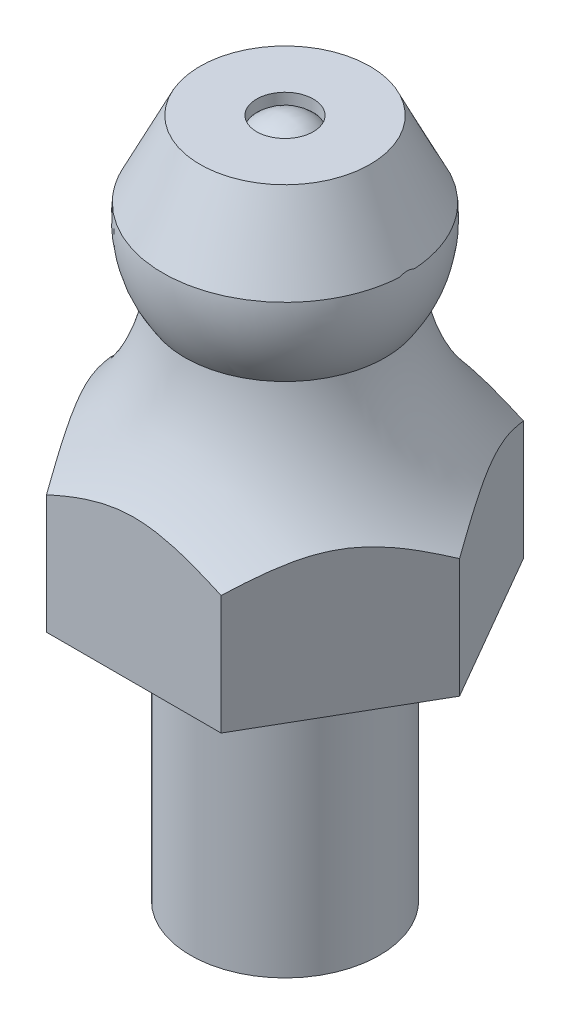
ISO-10303-21;
HEADER;
FILE_DESCRIPTION(('STEP AP214'),'2;1');
FILE_NAME('part.step','',(''),(''),'','','');
FILE_SCHEMA(('AUTOMOTIVE_DESIGN { 1 0 10303 214 1 1 1 1 }'));
ENDSEC;
DATA;
#1=APPLICATION_CONTEXT('core data for automotive mechanical design processes');
#2=APPLICATION_PROTOCOL_DEFINITION('international standard','automotive_design',2000,#1);
#3=PRODUCT_CONTEXT('',#1,'mechanical');
#4=PRODUCT('Part','Part','',(#3));
#5=PRODUCT_RELATED_PRODUCT_CATEGORY('part','',(#4));
#6=PRODUCT_DEFINITION_FORMATION('','',#4);
#7=PRODUCT_DEFINITION_CONTEXT('part definition',#1,'design');
#8=PRODUCT_DEFINITION('design','',#6,#7);
#9=PRODUCT_DEFINITION_SHAPE('','',#8);
#10=(LENGTH_UNIT() NAMED_UNIT(*) SI_UNIT(.MILLI.,.METRE.));
#11=(NAMED_UNIT(*) PLANE_ANGLE_UNIT() SI_UNIT($,.RADIAN.));
#12=(NAMED_UNIT(*) SI_UNIT($,.STERADIAN.) SOLID_ANGLE_UNIT());
#13=UNCERTAINTY_MEASURE_WITH_UNIT(LENGTH_MEASURE(1.E-05),#10,'distance_accuracy_value','');
#14=(GEOMETRIC_REPRESENTATION_CONTEXT(3) GLOBAL_UNCERTAINTY_ASSIGNED_CONTEXT((#13)) GLOBAL_UNIT_ASSIGNED_CONTEXT((#10,
#11,#12)) REPRESENTATION_CONTEXT('',''));
#15=CARTESIAN_POINT('',(0.,0.,0.));
#16=DIRECTION('',(0.,0.,1.));
#17=DIRECTION('',(1.,0.,0.));
#18=AXIS2_PLACEMENT_3D('',#15,#16,#17);
#19=CARTESIAN_POINT('',(-2.3094010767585,18.9047921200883,-4.));
#20=DIRECTION('',(0.,0.,-1.));
#21=DIRECTION('',(-1.,0.,0.));
#22=AXIS2_PLACEMENT_3D('',#19,#20,#21);
#23=PLANE('',#22);
#24=DIRECTION('',(0.,-1.,0.));
#25=VECTOR('',#24,1.);
#26=CARTESIAN_POINT('',(2.3094010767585,18.9047921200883,-4.));
#27=LINE('',#26,#25);
#28=CARTESIAN_POINT('',(2.30940107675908,10.1524874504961,-4.00000000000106));
#29=VERTEX_POINT('',#28);
#30=CARTESIAN_POINT('',(2.3094010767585,7.,-4.));
#31=VERTEX_POINT('',#30);
#32=EDGE_CURVE('P0_E61',#29,#31,#27,.T.);
#33=ORIENTED_EDGE('',*,*,#32,.T.);
#34=DIRECTION('',(-1.,0.,0.));
#35=VECTOR('',#34,1.);
#36=CARTESIAN_POINT('',(-2.3094010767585,7.,-4.));
#37=LINE('',#36,#35);
#38=CARTESIAN_POINT('',(-2.3094010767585,7.,-4.));
#39=VERTEX_POINT('',#38);
#40=EDGE_CURVE('P0_E55',#31,#39,#37,.T.);
#41=ORIENTED_EDGE('',*,*,#40,.T.);
#42=DIRECTION('',(0.,-1.,0.));
#43=VECTOR('',#42,1.);
#44=CARTESIAN_POINT('',(-2.3094010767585,18.9047921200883,-4.));
#45=LINE('',#44,#43);
#46=CARTESIAN_POINT('',(-2.3094010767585,10.1524874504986,-4.));
#47=VERTEX_POINT('',#46);
#48=EDGE_CURVE('P0_E128',#47,#39,#45,.T.);
#49=ORIENTED_EDGE('',*,*,#48,.F.);
#50=CARTESIAN_POINT('',(-2.3094010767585,10.1524874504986,-4.00000000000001));
#51=CARTESIAN_POINT('',(-2.24387314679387,10.1816552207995,-4.));
#52=CARTESIAN_POINT('',(-2.17823697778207,10.2105890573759,-4.));
#53=CARTESIAN_POINT('',(-2.0463662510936,10.2678099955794,-4.));
#54=CARTESIAN_POINT('',(-1.98013034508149,10.2960939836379,-4.));
#55=CARTESIAN_POINT('',(-1.84705880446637,10.3516571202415,-4.));
#56=CARTESIAN_POINT('',(-1.78022214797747,10.3789338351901,-4.));
#57=CARTESIAN_POINT('',(-1.64593091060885,10.4320775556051,-4.));
#58=CARTESIAN_POINT('',(-1.57847591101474,10.4579435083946,-4.));
#59=CARTESIAN_POINT('',(-1.44312447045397,10.5077528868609,-4.));
#60=CARTESIAN_POINT('',(-1.37523041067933,10.5317027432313,-4.));
#61=CARTESIAN_POINT('',(-1.23874756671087,10.5773084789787,-4.));
#62=CARTESIAN_POINT('',(-1.17015956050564,10.5989666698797,-4.));
#63=CARTESIAN_POINT('',(-1.03223820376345,10.6395079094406,-4.));
#64=CARTESIAN_POINT('',(-0.96290569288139,10.6583937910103,-4.));
#65=CARTESIAN_POINT('',(-0.823443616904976,10.6929039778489,-4.));
#66=CARTESIAN_POINT('',(-0.75331424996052,10.7085290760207,-4.));
#67=CARTESIAN_POINT('',(-0.613640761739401,10.735769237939,-4.));
#68=CARTESIAN_POINT('',(-0.544110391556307,10.7474541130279,-4.));
#69=CARTESIAN_POINT('',(-0.404466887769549,10.7668044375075,-4.));
#70=CARTESIAN_POINT('',(-0.334353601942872,10.7744688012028,-4.));
#71=CARTESIAN_POINT('',(-0.193792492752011,10.7854743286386,-4.));
#72=CARTESIAN_POINT('',(-0.123344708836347,10.7888159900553,-4.));
#73=CARTESIAN_POINT('',(0.0175925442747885,10.7910392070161,-4.));
#74=CARTESIAN_POINT('',(0.0880819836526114,10.7899226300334,-4.));
#75=CARTESIAN_POINT('',(0.228858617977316,10.783279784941,-4.));
#76=CARTESIAN_POINT('',(0.29914578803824,10.7777529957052,-4.));
#77=CARTESIAN_POINT('',(0.439230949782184,10.7625151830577,-4.));
#78=CARTESIAN_POINT('',(0.509029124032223,10.7528058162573,-4.));
#79=CARTESIAN_POINT('',(0.653519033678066,10.7286356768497,-4.));
#80=CARTESIAN_POINT('',(0.728157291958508,10.7138578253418,-4.));
#81=CARTESIAN_POINT('',(0.876576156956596,10.680398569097,-4.));
#82=CARTESIAN_POINT('',(0.950356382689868,10.6617154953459,-4.));
#83=CARTESIAN_POINT('',(1.09709634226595,10.6210262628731,-4.));
#84=CARTESIAN_POINT('',(1.170054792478,10.5990155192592,-4.));
#85=CARTESIAN_POINT('',(1.3151885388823,10.5522515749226,-4.));
#86=CARTESIAN_POINT('',(1.38736264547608,10.5274947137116,-4.));
#87=CARTESIAN_POINT('',(1.5314843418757,10.4756106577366,-4.));
#88=CARTESIAN_POINT('',(1.60342577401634,10.4484664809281,-4.));
#89=CARTESIAN_POINT('',(1.74657003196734,10.3925021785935,-4.));
#90=CARTESIAN_POINT('',(1.81777350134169,10.3636836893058,-4.));
#91=CARTESIAN_POINT('',(1.95944373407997,10.3048727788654,-4.));
#92=CARTESIAN_POINT('',(2.02991205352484,10.274884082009,-4.));
#93=CARTESIAN_POINT('',(2.17009322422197,10.2141768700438,-4.));
#94=CARTESIAN_POINT('',(2.23980809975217,10.1834630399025,-4.));
#95=CARTESIAN_POINT('',(2.30940107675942,10.1524874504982,-4.));
#96=B_SPLINE_CURVE_WITH_KNOTS('',3,(#50,#51,#52,#53,#54,#55,#56,#57,#58,#59,#60,#61,#62,#63,#64,
#65,#66,#67,#68,#69,#70,#71,#72,#73,#74,#75,#76,#77,#78,#79,#80,#81,#82,#83,#84,#85,#86,#87,#88,
#89,#90,#91,#92,#93,#94,#95),.UNSPECIFIED.,.F.,.F.,(4,2,2,2,2,2,2,2,2,2,2,2,2,2,2,2,2,2,2,2,2,2,
4),(0.,0.215184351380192,0.431245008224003,0.64779743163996,0.86450929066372,1.08046032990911,
1.29619142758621,1.51170052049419,1.72715714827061,1.93856663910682,2.15003318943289,
2.36147539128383,2.57282903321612,2.78420765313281,2.99550262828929,3.22364220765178,
3.45187948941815,3.68043415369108,3.90929722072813,4.13994537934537,4.37037180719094,
4.60011669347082,4.82864951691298),.UNSPECIFIED.);
#97=EDGE_CURVE('P0_E151',#47,#29,#96,.T.);
#98=ORIENTED_EDGE('',*,*,#97,.T.);
#99=EDGE_LOOP('',(#33,#41,#49,#98));
#100=FACE_BOUND('',#99,.T.);
#101=ADVANCED_FACE('P0_F40',(#100),#23,.T.);
#102=CARTESIAN_POINT('',(-4.61880215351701,18.9047921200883,0.));
#103=DIRECTION('',(-0.866025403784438,0.,-0.5));
#104=DIRECTION('',(-0.5,0.,0.866025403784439));
#105=AXIS2_PLACEMENT_3D('',#102,#103,#104);
#106=PLANE('',#105);
#107=ORIENTED_EDGE('',*,*,#48,.T.);
#108=DIRECTION('',(-0.5,0.,0.866025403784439));
#109=VECTOR('',#108,1.);
#110=CARTESIAN_POINT('',(-4.61880215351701,7.,0.));
#111=LINE('',#110,#109);
#112=CARTESIAN_POINT('',(-4.61880215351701,7.,0.));
#113=VERTEX_POINT('',#112);
#114=EDGE_CURVE('P0_E263',#39,#113,#111,.T.);
#115=ORIENTED_EDGE('',*,*,#114,.T.);
#116=DIRECTION('',(0.,-1.,0.));
#117=VECTOR('',#116,1.);
#118=CARTESIAN_POINT('',(-4.61880215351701,18.9047921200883,0.));
#119=LINE('',#118,#117);
#120=CARTESIAN_POINT('',(-4.61880215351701,10.1524874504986,0.));
#121=VERTEX_POINT('',#120);
#122=EDGE_CURVE('P0_E259',#121,#113,#119,.T.);
#123=ORIENTED_EDGE('',*,*,#122,.F.);
#124=CARTESIAN_POINT('',(-4.61880215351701,10.1524874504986,0.));
#125=CARTESIAN_POINT('',(-4.58603818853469,10.1816552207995,-0.0567488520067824));
#126=CARTESIAN_POINT('',(-4.55322010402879,10.2105890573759,-0.113591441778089));
#127=CARTESIAN_POINT('',(-4.48728474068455,10.2678099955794,-0.227794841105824));
#128=CARTESIAN_POINT('',(-4.4541667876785,10.2960939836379,-0.285156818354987));
#129=CARTESIAN_POINT('',(-4.38763101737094,10.3516571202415,-0.400400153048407));
#130=CARTESIAN_POINT('',(-4.35421268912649,10.3789338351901,-0.458282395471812));
#131=CARTESIAN_POINT('',(-4.28706707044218,10.4320775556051,-0.574582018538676));
#132=CARTESIAN_POINT('',(-4.25333957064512,10.4579435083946,-0.632999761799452));
#133=CARTESIAN_POINT('',(-4.18566385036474,10.5077528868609,-0.750217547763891));
#134=CARTESIAN_POINT('',(-4.15171682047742,10.5317027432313,-0.809015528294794));
#135=CARTESIAN_POINT('',(-4.08347539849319,10.5773084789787,-0.927213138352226));
#136=CARTESIAN_POINT('',(-4.04918139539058,10.5989666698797,-0.986612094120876));
#137=CARTESIAN_POINT('',(-3.98022071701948,10.6395079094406,-1.10605549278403));
#138=CARTESIAN_POINT('',(-3.94555446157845,10.6583937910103,-1.16609920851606));
#139=CARTESIAN_POINT('',(-3.87582342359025,10.6929039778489,-1.28687690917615));
#140=CARTESIAN_POINT('',(-3.84075874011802,10.7085290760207,-1.34761072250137));
#141=CARTESIAN_POINT('',(-3.77092199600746,10.735769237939,-1.46857151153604));
#142=CARTESIAN_POINT('',(-3.73615681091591,10.7474541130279,-1.52878657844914));
#143=CARTESIAN_POINT('',(-3.66633505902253,10.7668044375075,-1.64972140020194));
#144=CARTESIAN_POINT('',(-3.63127841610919,10.7744688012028,-1.71044128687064));
#145=CARTESIAN_POINT('',(-3.56099786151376,10.7854743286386,-1.83217077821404));
#146=CARTESIAN_POINT('',(-3.52577396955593,10.7888159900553,-1.89318034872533));
#147=CARTESIAN_POINT('',(-3.45530534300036,10.7910392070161,-2.01523559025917));
#148=CARTESIAN_POINT('',(-3.42006062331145,10.7899226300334,-2.07628123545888));
#149=CARTESIAN_POINT('',(-3.3496723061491,10.783279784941,-2.19819737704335));
#150=CARTESIAN_POINT('',(-3.31452872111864,10.7777529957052,-2.25906785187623));
#151=CARTESIAN_POINT('',(-3.24448614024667,10.7625151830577,-2.38038516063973));
#152=CARTESIAN_POINT('',(-3.20958705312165,10.7528058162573,-2.44083215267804));
#153=CARTESIAN_POINT('',(-3.13734209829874,10.7286356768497,-2.56596408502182));
#154=CARTESIAN_POINT('',(-3.10002296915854,10.7138578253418,-2.63060271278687));
#155=CARTESIAN_POINT('',(-3.02581353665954,10.6803985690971,-2.759137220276));
#156=CARTESIAN_POINT('',(-2.98892342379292,10.661715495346,-2.82303277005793));
#157=CARTESIAN_POINT('',(-2.91555344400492,10.6210262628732,-2.95011330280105));
#158=CARTESIAN_POINT('',(-2.87907421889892,10.5990155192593,-3.0132971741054));
#159=CARTESIAN_POINT('',(-2.8065073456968,10.5522515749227,-3.13898668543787));
#160=CARTESIAN_POINT('',(-2.77042029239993,10.5274947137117,-3.20149129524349));
#161=CARTESIAN_POINT('',(-2.69835944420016,10.4756106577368,-3.326304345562));
#162=CARTESIAN_POINT('',(-2.66238872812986,10.4484664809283,-3.3886074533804));
#163=CARTESIAN_POINT('',(-2.59081659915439,10.3925021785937,-3.51257401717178));
#164=CARTESIAN_POINT('',(-2.55521486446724,10.3636836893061,-3.57423803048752));
#165=CARTESIAN_POINT('',(-2.48437974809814,10.3048727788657,-3.69692805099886));
#166=CARTESIAN_POINT('',(-2.44914558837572,10.2748840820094,-3.75795540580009));
#167=CARTESIAN_POINT('',(-2.37905500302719,10.2141768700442,-3.87935586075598));
#168=CARTESIAN_POINT('',(-2.3441975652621,10.1834630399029,-3.93973071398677));
#169=CARTESIAN_POINT('',(-2.3094010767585,10.1524874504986,-4.00000000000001));
#170=B_SPLINE_CURVE_WITH_KNOTS('',3,(#124,#125,#126,#127,#128,#129,#130,#131,#132,#133,#134,
#135,#136,#137,#138,#139,#140,#141,#142,#143,#144,#145,#146,#147,#148,#149,#150,#151,#152,#153,
#154,#155,#156,#157,#158,#159,#160,#161,#162,#163,#164,#165,#166,#167,#168,#169),.UNSPECIFIED.,
.F.,.F.,(4,2,2,2,2,2,2,2,2,2,2,2,2,2,2,2,2,2,2,2,2,2,4),(0.,0.215184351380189,0.431245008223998,
0.647797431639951,0.864509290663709,1.0804603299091,1.2961914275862,1.51170052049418,
1.7271571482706,1.93856663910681,2.15003318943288,2.36147539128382,2.57282903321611,
2.7842076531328,2.99550262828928,3.22364220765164,3.45187948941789,3.6804341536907,
3.90929722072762,4.13994537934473,4.37037180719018,4.60011669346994,4.82864951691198),.UNSPECIFIED.);
#171=EDGE_CURVE('P0_E157',#121,#47,#170,.T.);
#172=ORIENTED_EDGE('',*,*,#171,.T.);
#173=EDGE_LOOP('',(#107,#115,#123,#172));
#174=FACE_BOUND('',#173,.T.);
#175=ADVANCED_FACE('P0_F147',(#174),#106,.T.);
#176=CARTESIAN_POINT('',(-2.3094010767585,18.9047921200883,4.));
#177=DIRECTION('',(-0.866025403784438,0.,0.5));
#178=DIRECTION('',(0.5,0.,0.866025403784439));
#179=AXIS2_PLACEMENT_3D('',#176,#177,#178);
#180=PLANE('',#179);
#181=ORIENTED_EDGE('',*,*,#122,.T.);
#182=DIRECTION('',(0.5,0.,0.866025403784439));
#183=VECTOR('',#182,1.);
#184=CARTESIAN_POINT('',(-2.3094010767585,7.,4.));
#185=LINE('',#184,#183);
#186=CARTESIAN_POINT('',(-2.3094010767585,7.,4.));
#187=VERTEX_POINT('',#186);
#188=EDGE_CURVE('P0_E269',#113,#187,#185,.T.);
#189=ORIENTED_EDGE('',*,*,#188,.T.);
#190=DIRECTION('',(0.,-1.,0.));
#191=VECTOR('',#190,1.);
#192=CARTESIAN_POINT('',(-2.3094010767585,18.9047921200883,4.));
#193=LINE('',#192,#191);
#194=CARTESIAN_POINT('',(-2.3094010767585,10.1524874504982,4.));
#195=VERTEX_POINT('',#194);
#196=EDGE_CURVE('P0_E116',#195,#187,#193,.T.);
#197=ORIENTED_EDGE('',*,*,#196,.F.);
#198=CARTESIAN_POINT('',(-2.30940107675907,10.1524874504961,4.00000000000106));
#199=CARTESIAN_POINT('',(-2.34216504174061,10.1816552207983,3.94325114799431));
#200=CARTESIAN_POINT('',(-2.37498312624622,10.2105890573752,3.88640855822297));
#201=CARTESIAN_POINT('',(-2.4409184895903,10.2678099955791,3.77220515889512));
#202=CARTESIAN_POINT('',(-2.47403644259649,10.2960939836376,3.71484318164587));
#203=CARTESIAN_POINT('',(-2.5405722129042,10.3516571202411,3.59959984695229));
#204=CARTESIAN_POINT('',(-2.57399054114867,10.3789338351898,3.54171760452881));
#205=CARTESIAN_POINT('',(-2.64113615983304,10.4320775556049,3.4254179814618));
#206=CARTESIAN_POINT('',(-2.67486365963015,10.4579435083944,3.36700023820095));
#207=CARTESIAN_POINT('',(-2.74253937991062,10.5077528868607,3.24978245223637));
#208=CARTESIAN_POINT('',(-2.77648640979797,10.5317027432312,3.19098447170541));
#209=CARTESIAN_POINT('',(-2.84472783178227,10.5773084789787,3.07278686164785));
#210=CARTESIAN_POINT('',(-2.87902183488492,10.5989666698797,3.01338790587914));
#211=CARTESIAN_POINT('',(-2.94798251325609,10.6395079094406,2.89394450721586));
#212=CARTESIAN_POINT('',(-2.98264876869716,10.6583937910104,2.83390079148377));
#213=CARTESIAN_POINT('',(-3.05237980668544,10.692903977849,2.71312309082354));
#214=CARTESIAN_POINT('',(-3.08744449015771,10.7085290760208,2.65238927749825));
#215=CARTESIAN_POINT('',(-3.15728123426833,10.7357692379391,2.53142848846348));
#216=CARTESIAN_POINT('',(-3.19204641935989,10.747454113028,2.47121342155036));
#217=CARTESIAN_POINT('',(-3.2618681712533,10.7668044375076,2.35027859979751));
#218=CARTESIAN_POINT('',(-3.29692481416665,10.7744688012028,2.28955871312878));
#219=CARTESIAN_POINT('',(-3.36720536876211,10.7854743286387,2.16782922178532));
#220=CARTESIAN_POINT('',(-3.40242926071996,10.7888159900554,2.10681965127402));
#221=CARTESIAN_POINT('',(-3.47289788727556,10.7910392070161,1.98476440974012));
#222=CARTESIAN_POINT('',(-3.50814260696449,10.7899226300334,1.92371876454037));
#223=CARTESIAN_POINT('',(-3.57853092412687,10.783279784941,1.80180262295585));
#224=CARTESIAN_POINT('',(-3.61367450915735,10.7777529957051,1.74093214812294));
#225=CARTESIAN_POINT('',(-3.68371709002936,10.7625151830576,1.61961483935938));
#226=CARTESIAN_POINT('',(-3.71861617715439,10.7528058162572,1.55916784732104));
#227=CARTESIAN_POINT('',(-3.79086113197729,10.7286356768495,1.43403591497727));
#228=CARTESIAN_POINT('',(-3.82818026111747,10.7138578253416,1.36939728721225));
#229=CARTESIAN_POINT('',(-3.90238969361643,10.6803985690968,1.24086277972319));
#230=CARTESIAN_POINT('',(-3.93927980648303,10.6617154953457,1.1769672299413));
#231=CARTESIAN_POINT('',(-4.01264978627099,10.621026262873,1.04988669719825));
#232=CARTESIAN_POINT('',(-4.04912901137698,10.5990155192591,0.986702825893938));
#233=CARTESIAN_POINT('',(-4.12169588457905,10.5522515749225,0.861013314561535));
#234=CARTESIAN_POINT('',(-4.1577829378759,10.5274947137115,0.798508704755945));
#235=CARTESIAN_POINT('',(-4.22984378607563,10.4756106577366,0.673695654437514));
#236=CARTESIAN_POINT('',(-4.26581450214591,10.4484664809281,0.611392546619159));
#237=CARTESIAN_POINT('',(-4.33738663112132,10.3925021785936,0.487425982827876));
#238=CARTESIAN_POINT('',(-4.37298836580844,10.363683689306,0.425761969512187));
#239=CARTESIAN_POINT('',(-4.44382348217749,10.3048727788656,0.303071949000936));
#240=CARTESIAN_POINT('',(-4.47905764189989,10.2748840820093,0.24204459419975));
#241=CARTESIAN_POINT('',(-4.54914822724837,10.2141768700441,0.120644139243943));
#242=CARTESIAN_POINT('',(-4.58400566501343,10.1834630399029,0.0602692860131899));
#243=CARTESIAN_POINT('',(-4.61880215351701,10.1524874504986,0.));
#244=B_SPLINE_CURVE_WITH_KNOTS('',3,(#198,#199,#200,#201,#202,#203,#204,#205,#206,#207,#208,
#209,#210,#211,#212,#213,#214,#215,#216,#217,#218,#219,#220,#221,#222,#223,#224,#225,#226,#227,
#228,#229,#230,#231,#232,#233,#234,#235,#236,#237,#238,#239,#240,#241,#242,#243),.UNSPECIFIED.,
.F.,.F.,(4,2,2,2,2,2,2,2,2,2,2,2,2,2,2,2,2,2,2,2,2,2,4),(0.,0.215184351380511,0.431245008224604,
0.647797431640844,0.864509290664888,1.0804603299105,1.29619142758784,1.51170052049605,
1.7271571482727,1.93856663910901,2.15003318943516,2.36147539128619,2.57282903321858,
2.78420765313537,2.99550262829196,3.22364220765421,3.45187948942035,3.68043415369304,
3.90929722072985,4.13994537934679,4.37037180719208,4.60011669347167,4.82864951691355),.UNSPECIFIED.);
#245=EDGE_CURVE('P0_E240',#195,#121,#244,.T.);
#246=ORIENTED_EDGE('',*,*,#245,.T.);
#247=EDGE_LOOP('',(#181,#189,#197,#246));
#248=FACE_BOUND('',#247,.T.);
#249=ADVANCED_FACE('P0_F233',(#248),#180,.T.);
#250=CARTESIAN_POINT('',(2.3094010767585,18.9047921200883,4.));
#251=DIRECTION('',(0.,0.,1.));
#252=DIRECTION('',(1.,0.,0.));
#253=AXIS2_PLACEMENT_3D('',#250,#251,#252);
#254=PLANE('',#253);
#255=ORIENTED_EDGE('',*,*,#196,.T.);
#256=DIRECTION('',(1.,0.,0.));
#257=VECTOR('',#256,1.);
#258=CARTESIAN_POINT('',(2.3094010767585,7.,4.));
#259=LINE('',#258,#257);
#260=CARTESIAN_POINT('',(2.3094010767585,7.,4.));
#261=VERTEX_POINT('',#260);
#262=EDGE_CURVE('P0_E109',#187,#261,#259,.T.);
#263=ORIENTED_EDGE('',*,*,#262,.T.);
#264=DIRECTION('',(0.,-1.,0.));
#265=VECTOR('',#264,1.);
#266=CARTESIAN_POINT('',(2.3094010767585,18.9047921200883,4.));
#267=LINE('',#266,#265);
#268=CARTESIAN_POINT('',(2.3094010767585,10.1524874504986,4.));
#269=VERTEX_POINT('',#268);
#270=EDGE_CURVE('P0_E108',#269,#261,#267,.T.);
#271=ORIENTED_EDGE('',*,*,#270,.F.);
#272=CARTESIAN_POINT('',(2.30940107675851,10.1524874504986,4.));
#273=CARTESIAN_POINT('',(2.24387314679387,10.1816552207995,4.));
#274=CARTESIAN_POINT('',(2.17823697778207,10.2105890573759,4.));
#275=CARTESIAN_POINT('',(2.0463662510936,10.2678099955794,4.));
#276=CARTESIAN_POINT('',(1.98013034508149,10.2960939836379,4.));
#277=CARTESIAN_POINT('',(1.84705880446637,10.3516571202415,4.));
#278=CARTESIAN_POINT('',(1.78022214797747,10.3789338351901,4.));
#279=CARTESIAN_POINT('',(1.64593091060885,10.4320775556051,4.));
#280=CARTESIAN_POINT('',(1.57847591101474,10.4579435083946,4.));
#281=CARTESIAN_POINT('',(1.44312447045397,10.5077528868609,4.));
#282=CARTESIAN_POINT('',(1.37523041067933,10.5317027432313,4.));
#283=CARTESIAN_POINT('',(1.23874756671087,10.5773084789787,4.));
#284=CARTESIAN_POINT('',(1.17015956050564,10.5989666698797,4.));
#285=CARTESIAN_POINT('',(1.03223820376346,10.6395079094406,4.));
#286=CARTESIAN_POINT('',(0.962905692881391,10.6583937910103,4.));
#287=CARTESIAN_POINT('',(0.823443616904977,10.6929039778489,4.));
#288=CARTESIAN_POINT('',(0.753314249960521,10.7085290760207,4.));
#289=CARTESIAN_POINT('',(0.613640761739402,10.735769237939,4.));
#290=CARTESIAN_POINT('',(0.544110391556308,10.7474541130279,4.));
#291=CARTESIAN_POINT('',(0.40446688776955,10.7668044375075,4.));
#292=CARTESIAN_POINT('',(0.334353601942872,10.7744688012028,4.));
#293=CARTESIAN_POINT('',(0.193792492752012,10.7854743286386,4.));
#294=CARTESIAN_POINT('',(0.123344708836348,10.7888159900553,4.));
#295=CARTESIAN_POINT('',(-0.0175925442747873,10.7910392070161,4.));
#296=CARTESIAN_POINT('',(-0.0880819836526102,10.7899226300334,4.));
#297=CARTESIAN_POINT('',(-0.228858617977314,10.783279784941,4.));
#298=CARTESIAN_POINT('',(-0.299145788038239,10.7777529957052,4.));
#299=CARTESIAN_POINT('',(-0.439230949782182,10.7625151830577,4.));
#300=CARTESIAN_POINT('',(-0.509029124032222,10.7528058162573,4.));
#301=CARTESIAN_POINT('',(-0.653519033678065,10.7286356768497,4.));
#302=CARTESIAN_POINT('',(-0.728157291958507,10.7138578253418,4.));
#303=CARTESIAN_POINT('',(-0.876576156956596,10.680398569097,4.));
#304=CARTESIAN_POINT('',(-0.950356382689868,10.6617154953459,4.));
#305=CARTESIAN_POINT('',(-1.09709634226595,10.6210262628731,4.));
#306=CARTESIAN_POINT('',(-1.170054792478,10.5990155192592,4.));
#307=CARTESIAN_POINT('',(-1.3151885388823,10.5522515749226,4.));
#308=CARTESIAN_POINT('',(-1.38736264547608,10.5274947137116,4.));
#309=CARTESIAN_POINT('',(-1.5314843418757,10.4756106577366,4.));
#310=CARTESIAN_POINT('',(-1.60342577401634,10.4484664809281,4.));
#311=CARTESIAN_POINT('',(-1.74657003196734,10.3925021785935,4.));
#312=CARTESIAN_POINT('',(-1.81777350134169,10.3636836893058,4.));
#313=CARTESIAN_POINT('',(-1.95944373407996,10.3048727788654,4.));
#314=CARTESIAN_POINT('',(-2.02991205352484,10.274884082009,4.));
#315=CARTESIAN_POINT('',(-2.17009322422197,10.2141768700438,4.));
#316=CARTESIAN_POINT('',(-2.23980809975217,10.1834630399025,4.));
#317=CARTESIAN_POINT('',(-2.30940107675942,10.1524874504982,4.));
#318=B_SPLINE_CURVE_WITH_KNOTS('',3,(#272,#273,#274,#275,#276,#277,#278,#279,#280,#281,#282,
#283,#284,#285,#286,#287,#288,#289,#290,#291,#292,#293,#294,#295,#296,#297,#298,#299,#300,#301,
#302,#303,#304,#305,#306,#307,#308,#309,#310,#311,#312,#313,#314,#315,#316,#317),.UNSPECIFIED.,
.F.,.F.,(4,2,2,2,2,2,2,2,2,2,2,2,2,2,2,2,2,2,2,2,2,2,4),(0.,0.215184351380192,0.431245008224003,
0.64779743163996,0.86450929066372,1.08046032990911,1.29619142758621,1.51170052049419,
1.72715714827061,1.93856663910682,2.15003318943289,2.36147539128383,2.57282903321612,
2.78420765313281,2.99550262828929,3.22364220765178,3.45187948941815,3.68043415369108,
3.90929722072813,4.13994537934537,4.37037180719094,4.60011669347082,4.82864951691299),.UNSPECIFIED.);
#319=EDGE_CURVE('P0_E244',#269,#195,#318,.T.);
#320=ORIENTED_EDGE('',*,*,#319,.T.);
#321=EDGE_LOOP('',(#255,#263,#271,#320));
#322=FACE_BOUND('',#321,.T.);
#323=ADVANCED_FACE('P0_F237',(#322),#254,.T.);
#324=CARTESIAN_POINT('',(4.61880215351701,18.9047921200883,0.));
#325=DIRECTION('',(0.866025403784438,0.,0.5));
#326=DIRECTION('',(0.5,0.,-0.866025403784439));
#327=AXIS2_PLACEMENT_3D('',#324,#325,#326);
#328=PLANE('',#327);
#329=ORIENTED_EDGE('',*,*,#270,.T.);
#330=DIRECTION('',(0.5,0.,-0.866025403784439));
#331=VECTOR('',#330,1.);
#332=CARTESIAN_POINT('',(4.61880215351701,7.,0.));
#333=LINE('',#332,#331);
#334=CARTESIAN_POINT('',(4.61880215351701,7.,0.));
#335=VERTEX_POINT('',#334);
#336=EDGE_CURVE('P0_E98',#261,#335,#333,.T.);
#337=ORIENTED_EDGE('',*,*,#336,.T.);
#338=DIRECTION('',(0.,-1.,0.));
#339=VECTOR('',#338,1.);
#340=CARTESIAN_POINT('',(4.61880215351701,18.9047921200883,0.));
#341=LINE('',#340,#339);
#342=CARTESIAN_POINT('',(4.61880215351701,10.1524874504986,0.));
#343=VERTEX_POINT('',#342);
#344=EDGE_CURVE('P0_E105',#343,#335,#341,.T.);
#345=ORIENTED_EDGE('',*,*,#344,.F.);
#346=CARTESIAN_POINT('',(4.61880215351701,10.1524874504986,0.));
#347=CARTESIAN_POINT('',(4.58603818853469,10.1816552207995,0.0567488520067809));
#348=CARTESIAN_POINT('',(4.55322010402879,10.2105890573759,0.113591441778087));
#349=CARTESIAN_POINT('',(4.48728474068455,10.2678099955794,0.227794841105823));
#350=CARTESIAN_POINT('',(4.4541667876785,10.2960939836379,0.285156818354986));
#351=CARTESIAN_POINT('',(4.38763101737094,10.3516571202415,0.400400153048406));
#352=CARTESIAN_POINT('',(4.35421268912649,10.3789338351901,0.458282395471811));
#353=CARTESIAN_POINT('',(4.28706707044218,10.4320775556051,0.574582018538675));
#354=CARTESIAN_POINT('',(4.25333957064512,10.4579435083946,0.632999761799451));
#355=CARTESIAN_POINT('',(4.18566385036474,10.5077528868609,0.75021754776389));
#356=CARTESIAN_POINT('',(4.15171682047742,10.5317027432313,0.809015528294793));
#357=CARTESIAN_POINT('',(4.08347539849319,10.5773084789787,0.927213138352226));
#358=CARTESIAN_POINT('',(4.04918139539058,10.5989666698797,0.986612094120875));
#359=CARTESIAN_POINT('',(3.98022071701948,10.6395079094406,1.10605549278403));
#360=CARTESIAN_POINT('',(3.94555446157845,10.6583937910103,1.16609920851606));
#361=CARTESIAN_POINT('',(3.87582342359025,10.6929039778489,1.28687690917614));
#362=CARTESIAN_POINT('',(3.84075874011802,10.7085290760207,1.34761072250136));
#363=CARTESIAN_POINT('',(3.77092199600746,10.735769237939,1.46857151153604));
#364=CARTESIAN_POINT('',(3.73615681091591,10.7474541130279,1.52878657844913));
#365=CARTESIAN_POINT('',(3.66633505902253,10.7668044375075,1.64972140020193));
#366=CARTESIAN_POINT('',(3.63127841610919,10.7744688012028,1.71044128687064));
#367=CARTESIAN_POINT('',(3.56099786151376,10.7854743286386,1.83217077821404));
#368=CARTESIAN_POINT('',(3.52577396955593,10.7888159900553,1.89318034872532));
#369=CARTESIAN_POINT('',(3.45530534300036,10.7910392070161,2.01523559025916));
#370=CARTESIAN_POINT('',(3.42006062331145,10.7899226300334,2.07628123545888));
#371=CARTESIAN_POINT('',(3.3496723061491,10.783279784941,2.19819737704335));
#372=CARTESIAN_POINT('',(3.31452872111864,10.7777529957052,2.25906785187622));
#373=CARTESIAN_POINT('',(3.24448614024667,10.7625151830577,2.38038516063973));
#374=CARTESIAN_POINT('',(3.20958705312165,10.7528058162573,2.44083215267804));
#375=CARTESIAN_POINT('',(3.13734209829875,10.7286356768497,2.56596408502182));
#376=CARTESIAN_POINT('',(3.10002296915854,10.7138578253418,2.63060271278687));
#377=CARTESIAN_POINT('',(3.02581353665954,10.6803985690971,2.759137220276));
#378=CARTESIAN_POINT('',(2.98892342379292,10.661715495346,2.82303277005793));
#379=CARTESIAN_POINT('',(2.91555344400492,10.6210262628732,2.95011330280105));
#380=CARTESIAN_POINT('',(2.87907421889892,10.5990155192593,3.01329717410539));
#381=CARTESIAN_POINT('',(2.8065073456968,10.5522515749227,3.13898668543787));
#382=CARTESIAN_POINT('',(2.77042029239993,10.5274947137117,3.20149129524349));
#383=CARTESIAN_POINT('',(2.69835944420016,10.4756106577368,3.326304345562));
#384=CARTESIAN_POINT('',(2.66238872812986,10.4484664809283,3.3886074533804));
#385=CARTESIAN_POINT('',(2.59081659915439,10.3925021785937,3.51257401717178));
#386=CARTESIAN_POINT('',(2.55521486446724,10.3636836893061,3.57423803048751));
#387=CARTESIAN_POINT('',(2.48437974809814,10.3048727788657,3.69692805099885));
#388=CARTESIAN_POINT('',(2.44914558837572,10.2748840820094,3.75795540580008));
#389=CARTESIAN_POINT('',(2.37905500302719,10.2141768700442,3.87935586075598));
#390=CARTESIAN_POINT('',(2.3441975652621,10.1834630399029,3.93973071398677));
#391=CARTESIAN_POINT('',(2.3094010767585,10.1524874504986,4.00000000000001));
#392=B_SPLINE_CURVE_WITH_KNOTS('',3,(#346,#347,#348,#349,#350,#351,#352,#353,#354,#355,#356,
#357,#358,#359,#360,#361,#362,#363,#364,#365,#366,#367,#368,#369,#370,#371,#372,#373,#374,#375,
#376,#377,#378,#379,#380,#381,#382,#383,#384,#385,#386,#387,#388,#389,#390,#391),.UNSPECIFIED.,
.F.,.F.,(4,2,2,2,2,2,2,2,2,2,2,2,2,2,2,2,2,2,2,2,2,2,4),(0.,0.21518435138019,0.431245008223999,
0.647797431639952,0.86450929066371,1.0804603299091,1.2961914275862,1.51170052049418,
1.7271571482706,1.93856663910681,2.15003318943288,2.36147539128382,2.57282903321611,
2.7842076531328,2.99550262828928,3.22364220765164,3.45187948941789,3.6804341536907,
3.90929722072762,4.13994537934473,4.37037180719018,4.60011669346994,4.82864951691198),.UNSPECIFIED.);
#393=EDGE_CURVE('P0_E127',#343,#269,#392,.T.);
#394=ORIENTED_EDGE('',*,*,#393,.T.);
#395=EDGE_LOOP('',(#329,#337,#345,#394));
#396=FACE_BOUND('',#395,.T.);
#397=ADVANCED_FACE('P0_F104',(#396),#328,.T.);
#398=CARTESIAN_POINT('',(2.3094010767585,18.9047921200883,-4.));
#399=DIRECTION('',(0.866025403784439,0.,-0.5));
#400=DIRECTION('',(-0.5,0.,-0.866025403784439));
#401=AXIS2_PLACEMENT_3D('',#398,#399,#400);
#402=PLANE('',#401);
#403=ORIENTED_EDGE('',*,*,#344,.T.);
#404=DIRECTION('',(-0.5,0.,-0.866025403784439));
#405=VECTOR('',#404,1.);
#406=CARTESIAN_POINT('',(2.3094010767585,7.,-4.));
#407=LINE('',#406,#405);
#408=EDGE_CURVE('P0_E12',#335,#31,#407,.T.);
#409=ORIENTED_EDGE('',*,*,#408,.T.);
#410=ORIENTED_EDGE('',*,*,#32,.F.);
#411=CARTESIAN_POINT('',(2.30940107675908,10.1524874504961,-4.00000000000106));
#412=CARTESIAN_POINT('',(2.34216504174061,10.1816552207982,-3.94325114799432));
#413=CARTESIAN_POINT('',(2.37498312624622,10.2105890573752,-3.88640855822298));
#414=CARTESIAN_POINT('',(2.4409184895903,10.2678099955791,-3.77220515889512));
#415=CARTESIAN_POINT('',(2.47403644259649,10.2960939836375,-3.71484318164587));
#416=CARTESIAN_POINT('',(2.5405722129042,10.3516571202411,-3.59959984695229));
#417=CARTESIAN_POINT('',(2.57399054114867,10.3789338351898,-3.54171760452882));
#418=CARTESIAN_POINT('',(2.64113615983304,10.4320775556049,-3.4254179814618));
#419=CARTESIAN_POINT('',(2.67486365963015,10.4579435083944,-3.36700023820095));
#420=CARTESIAN_POINT('',(2.74253937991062,10.5077528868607,-3.24978245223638));
#421=CARTESIAN_POINT('',(2.77648640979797,10.5317027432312,-3.19098447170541));
#422=CARTESIAN_POINT('',(2.84472783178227,10.5773084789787,-3.07278686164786));
#423=CARTESIAN_POINT('',(2.87902183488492,10.5989666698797,-3.01338790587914));
#424=CARTESIAN_POINT('',(2.94798251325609,10.6395079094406,-2.89394450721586));
#425=CARTESIAN_POINT('',(2.98264876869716,10.6583937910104,-2.83390079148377));
#426=CARTESIAN_POINT('',(3.05237980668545,10.692903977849,-2.71312309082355));
#427=CARTESIAN_POINT('',(3.08744449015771,10.7085290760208,-2.65238927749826));
#428=CARTESIAN_POINT('',(3.15728123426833,10.7357692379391,-2.53142848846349));
#429=CARTESIAN_POINT('',(3.19204641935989,10.747454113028,-2.47121342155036));
#430=CARTESIAN_POINT('',(3.2618681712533,10.7668044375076,-2.35027859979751));
#431=CARTESIAN_POINT('',(3.29692481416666,10.7744688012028,-2.28955871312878));
#432=CARTESIAN_POINT('',(3.36720536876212,10.7854743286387,-2.16782922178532));
#433=CARTESIAN_POINT('',(3.40242926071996,10.7888159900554,-2.10681965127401));
#434=CARTESIAN_POINT('',(3.47289788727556,10.7910392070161,-1.98476440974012));
#435=CARTESIAN_POINT('',(3.50814260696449,10.7899226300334,-1.92371876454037));
#436=CARTESIAN_POINT('',(3.57853092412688,10.7832797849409,-1.80180262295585));
#437=CARTESIAN_POINT('',(3.61367450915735,10.7777529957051,-1.74093214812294));
#438=CARTESIAN_POINT('',(3.68371709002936,10.7625151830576,-1.61961483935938));
#439=CARTESIAN_POINT('',(3.7186161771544,10.7528058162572,-1.55916784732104));
#440=CARTESIAN_POINT('',(3.79086113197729,10.7286356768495,-1.43403591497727));
#441=CARTESIAN_POINT('',(3.82818026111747,10.7138578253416,-1.36939728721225));
#442=CARTESIAN_POINT('',(3.90238969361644,10.6803985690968,-1.24086277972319));
#443=CARTESIAN_POINT('',(3.93927980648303,10.6617154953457,-1.1769672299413));
#444=CARTESIAN_POINT('',(4.01264978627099,10.621026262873,-1.04988669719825));
#445=CARTESIAN_POINT('',(4.04912901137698,10.5990155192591,-0.986702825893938));
#446=CARTESIAN_POINT('',(4.12169588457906,10.5522515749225,-0.861013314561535));
#447=CARTESIAN_POINT('',(4.1577829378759,10.5274947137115,-0.798508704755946));
#448=CARTESIAN_POINT('',(4.22984378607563,10.4756106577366,-0.673695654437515));
#449=CARTESIAN_POINT('',(4.26581450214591,10.4484664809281,-0.61139254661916));
#450=CARTESIAN_POINT('',(4.33738663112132,10.3925021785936,-0.487425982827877));
#451=CARTESIAN_POINT('',(4.37298836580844,10.363683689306,-0.425761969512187));
#452=CARTESIAN_POINT('',(4.44382348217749,10.3048727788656,-0.303071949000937));
#453=CARTESIAN_POINT('',(4.47905764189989,10.2748840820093,-0.242044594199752));
#454=CARTESIAN_POINT('',(4.54914822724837,10.2141768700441,-0.120644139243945));
#455=CARTESIAN_POINT('',(4.58400566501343,10.1834630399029,-0.0602692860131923));
#456=CARTESIAN_POINT('',(4.61880215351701,10.1524874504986,0.));
#457=B_SPLINE_CURVE_WITH_KNOTS('',3,(#411,#412,#413,#414,#415,#416,#417,#418,#419,#420,#421,
#422,#423,#424,#425,#426,#427,#428,#429,#430,#431,#432,#433,#434,#435,#436,#437,#438,#439,#440,
#441,#442,#443,#444,#445,#446,#447,#448,#449,#450,#451,#452,#453,#454,#455,#456),.UNSPECIFIED.,
.F.,.F.,(4,2,2,2,2,2,2,2,2,2,2,2,2,2,2,2,2,2,2,2,2,2,4),(0.,0.215184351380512,0.431245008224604,
0.647797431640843,0.864509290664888,1.0804603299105,1.29619142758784,1.51170052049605,
1.72715714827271,1.93856663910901,2.15003318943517,2.36147539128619,2.57282903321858,
2.78420765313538,2.99550262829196,3.22364220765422,3.45187948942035,3.68043415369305,
3.90929722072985,4.13994537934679,4.37037180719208,4.60011669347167,4.82864951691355),.UNSPECIFIED.);
#458=EDGE_CURVE('P0_E114',#29,#343,#457,.T.);
#459=ORIENTED_EDGE('',*,*,#458,.T.);
#460=EDGE_LOOP('',(#403,#409,#410,#459));
#461=FACE_BOUND('',#460,.T.);
#462=ADVANCED_FACE('P0_F112',(#461),#402,.T.);
#463=CARTESIAN_POINT('',(0.,14.7,0.));
#464=DIRECTION('',(0.,1.,0.));
#465=DIRECTION('',(0.,0.,1.));
#466=AXIS2_PLACEMENT_3D('',#463,#464,#465);
#467=TOROIDAL_SURFACE('',#466,8.66819882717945,6.08912832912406);
#468=CARTESIAN_POINT('',(0.,13.7733033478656,0.));
#469=DIRECTION('',(0.,1.,0.));
#470=DIRECTION('',(0.,0.,1.));
#471=AXIS2_PLACEMENT_3D('',#468,#469,#470);
#472=CIRCLE('',#471,2.65);
#473=CARTESIAN_POINT('',(0.,13.7733033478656,2.65));
#474=VERTEX_POINT('',#473);
#475=EDGE_CURVE('P0_E211',#474,#474,#472,.T.);
#476=ORIENTED_EDGE('',*,*,#475,.F.);
#477=EDGE_LOOP('',(#476));
#478=FACE_BOUND('',#477,.T.);
#479=ORIENTED_EDGE('',*,*,#97,.F.);
#480=ORIENTED_EDGE('',*,*,#171,.F.);
#481=ORIENTED_EDGE('',*,*,#245,.F.);
#482=ORIENTED_EDGE('',*,*,#319,.F.);
#483=ORIENTED_EDGE('',*,*,#393,.F.);
#484=ORIENTED_EDGE('',*,*,#458,.F.);
#485=EDGE_LOOP('',(#479,#480,#481,#482,#483,#484));
#486=FACE_BOUND('',#485,.T.);
#487=ADVANCED_FACE('P0_F134',(#478,#486),#467,.F.);
#488=CARTESIAN_POINT('',(5.5,9.5,0.));
#489=DIRECTION('',(0.,-1.,0.));
#490=DIRECTION('',(0.,0.,-1.));
#491=AXIS2_PLACEMENT_3D('',#488,#489,#490);
#492=PLANE('',#491);
#493=CARTESIAN_POINT('',(0.,9.5,0.));
#494=DIRECTION('',(0.,1.,0.));
#495=DIRECTION('',(0.,0.,1.));
#496=AXIS2_PLACEMENT_3D('',#493,#494,#495);
#497=CIRCLE('',#496,1.5);
#498=CARTESIAN_POINT('',(0.,9.5,1.5));
#499=VERTEX_POINT('',#498);
#500=EDGE_CURVE('P0_E156',#499,#499,#497,.T.);
#501=ORIENTED_EDGE('',*,*,#500,.T.);
#502=EDGE_LOOP('',(#501));
#503=FACE_BOUND('',#502,.T.);
#504=ADVANCED_FACE('P0_F42',(#503),#492,.F.);
#505=CARTESIAN_POINT('',(0.,18.,0.));
#506=DIRECTION('',(0.,1.,0.));
#507=DIRECTION('',(0.,0.,1.));
#508=AXIS2_PLACEMENT_3D('',#505,#506,#507);
#509=CYLINDRICAL_SURFACE('',#508,1.5);
#510=CARTESIAN_POINT('',(0.,16.9393398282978,0.));
#511=DIRECTION('',(0.,-1.,0.));
#512=DIRECTION('',(0.,0.,-1.));
#513=AXIS2_PLACEMENT_3D('',#510,#511,#512);
#514=CIRCLE('',#513,1.50000000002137);
#515=CARTESIAN_POINT('',(0.,16.9393398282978,-1.50000000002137));
#516=VERTEX_POINT('',#515);
#517=EDGE_CURVE('P0_E198',#516,#516,#514,.F.);
#518=ORIENTED_EDGE('',*,*,#517,.T.);
#519=EDGE_LOOP('',(#518));
#520=FACE_BOUND('',#519,.T.);
#521=ORIENTED_EDGE('',*,*,#500,.F.);
#522=EDGE_LOOP('',(#521));
#523=FACE_BOUND('',#522,.T.);
#524=ADVANCED_FACE('P0_F187',(#520,#523),#509,.F.);
#525=CARTESIAN_POINT('',(0.,16.9393398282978,0.));
#526=DIRECTION('',(0.,-1.,0.));
#527=DIRECTION('',(0.,0.,-1.));
#528=AXIS2_PLACEMENT_3D('',#525,#526,#527);
#529=CONICAL_SURFACE('',#528,1.50000000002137,0.785398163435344);
#530=ORIENTED_EDGE('',*,*,#517,.F.);
#531=EDGE_LOOP('',(#530));
#532=FACE_BOUND('',#531,.T.);
#533=CARTESIAN_POINT('',(0.,17.6893398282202,0.));
#534=DIRECTION('',(0.,1.,0.));
#535=DIRECTION('',(0.,0.,1.));
#536=AXIS2_PLACEMENT_3D('',#533,#534,#535);
#537=CIRCLE('',#536,0.749999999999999);
#538=CARTESIAN_POINT('',(0.,17.6893398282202,0.749999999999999));
#539=VERTEX_POINT('',#538);
#540=EDGE_CURVE('P0_E167',#539,#539,#537,.T.);
#541=ORIENTED_EDGE('',*,*,#540,.T.);
#542=EDGE_LOOP('',(#541));
#543=FACE_BOUND('',#542,.T.);
#544=ADVANCED_FACE('P0_F184',(#532,#543),#529,.F.);
#545=CARTESIAN_POINT('',(0.,18.,0.));
#546=DIRECTION('',(0.,1.,0.));
#547=DIRECTION('',(0.,0.,1.));
#548=AXIS2_PLACEMENT_3D('',#545,#546,#547);
#549=CYLINDRICAL_SURFACE('',#548,0.749999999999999);
#550=CARTESIAN_POINT('',(0.,18.,0.));
#551=DIRECTION('',(0.,1.,0.));
#552=DIRECTION('',(0.,0.,1.));
#553=AXIS2_PLACEMENT_3D('',#550,#551,#552);
#554=CIRCLE('',#553,0.749999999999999);
#555=CARTESIAN_POINT('',(0.,18.,0.749999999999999));
#556=VERTEX_POINT('',#555);
#557=EDGE_CURVE('P0_E202',#556,#556,#554,.F.);
#558=ORIENTED_EDGE('',*,*,#557,.F.);
#559=EDGE_LOOP('',(#558));
#560=FACE_BOUND('',#559,.T.);
#561=ORIENTED_EDGE('',*,*,#540,.F.);
#562=EDGE_LOOP('',(#561));
#563=FACE_BOUND('',#562,.T.);
#564=ADVANCED_FACE('P0_F180',(#560,#563),#549,.F.);
#565=CARTESIAN_POINT('',(0.749999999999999,18.,0.));
#566=DIRECTION('',(0.,1.,0.));
#567=DIRECTION('',(0.,0.,1.));
#568=AXIS2_PLACEMENT_3D('',#565,#566,#567);
#569=PLANE('',#568);
#570=ORIENTED_EDGE('',*,*,#557,.T.);
#571=EDGE_LOOP('',(#570));
#572=FACE_BOUND('',#571,.T.);
#573=CARTESIAN_POINT('',(0.,17.9999999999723,0.));
#574=DIRECTION('',(0.,-1.,0.));
#575=DIRECTION('',(0.,0.,-1.));
#576=AXIS2_PLACEMENT_3D('',#573,#574,#575);
#577=CIRCLE('',#576,2.25000000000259);
#578=CARTESIAN_POINT('',(0.,17.9999999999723,-2.25000000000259));
#579=VERTEX_POINT('',#578);
#580=EDGE_CURVE('P0_E205',#579,#579,#577,.T.);
#581=ORIENTED_EDGE('',*,*,#580,.F.);
#582=EDGE_LOOP('',(#581));
#583=FACE_BOUND('',#582,.T.);
#584=ADVANCED_FACE('P0_F176',(#572,#583),#569,.T.);
#585=CARTESIAN_POINT('',(0.,16.0000000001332,0.));
#586=DIRECTION('',(0.,-1.,0.));
#587=DIRECTION('',(0.,0.,-1.));
#588=AXIS2_PLACEMENT_3D('',#585,#586,#587);
#589=CONICAL_SURFACE('',#588,3.2316143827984,0.456266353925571);
#590=CARTESIAN_POINT('',(0.,15.9999999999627,0.));
#591=DIRECTION('',(0.,-1.,0.));
#592=DIRECTION('',(0.,0.,-1.));
#593=AXIS2_PLACEMENT_3D('',#590,#591,#592);
#594=CIRCLE('',#593,3.2316143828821);
#595=CARTESIAN_POINT('',(0.,15.9999999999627,-3.2316143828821));
#596=VERTEX_POINT('',#595);
#597=EDGE_CURVE('P0_E208',#596,#596,#594,.T.);
#598=ORIENTED_EDGE('',*,*,#597,.F.);
#599=EDGE_LOOP('',(#598));
#600=FACE_BOUND('',#599,.T.);
#601=ORIENTED_EDGE('',*,*,#580,.T.);
#602=EDGE_LOOP('',(#601));
#603=FACE_BOUND('',#602,.T.);
#604=ADVANCED_FACE('P0_F172',(#600,#603),#589,.T.);
#605=CARTESIAN_POINT('',(0.,15.6547921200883,0.));
#606=DIRECTION('',(1.,0.,0.));
#607=DIRECTION('',(0.,-1.,0.));
#608=AXIS2_PLACEMENT_3D('',#605,#606,#607);
#609=SPHERICAL_SURFACE('',#608,3.25);
#610=CARTESIAN_POINT('',(-3.25,15.6547921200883,0.));
#611=VERTEX_POINT('',#610);
#612=VERTEX_LOOP('',#611);
#613=FACE_BOUND('',#612,.T.);
#614=ORIENTED_EDGE('',*,*,#597,.T.);
#615=EDGE_LOOP('',(#614));
#616=FACE_BOUND('',#615,.T.);
#617=CARTESIAN_POINT('',(3.25,15.6547921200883,0.));
#618=VERTEX_POINT('',#617);
#619=VERTEX_LOOP('',#618);
#620=FACE_BOUND('',#619,.T.);
#621=ORIENTED_EDGE('',*,*,#475,.T.);
#622=EDGE_LOOP('',(#621));
#623=FACE_BOUND('',#622,.T.);
#624=ADVANCED_FACE('P0_F169',(#613,#616,#620,#623),#609,.T.);
#625=CARTESIAN_POINT('',(0.,7.,0.));
#626=DIRECTION('',(0.,-1.,0.));
#627=DIRECTION('',(0.,0.,-1.));
#628=AXIS2_PLACEMENT_3D('',#625,#626,#627);
#629=PLANE('',#628);
#630=ORIENTED_EDGE('',*,*,#408,.F.);
#631=ORIENTED_EDGE('',*,*,#336,.F.);
#632=ORIENTED_EDGE('',*,*,#262,.F.);
#633=ORIENTED_EDGE('',*,*,#188,.F.);
#634=ORIENTED_EDGE('',*,*,#114,.F.);
#635=ORIENTED_EDGE('',*,*,#40,.F.);
#636=EDGE_LOOP('',(#630,#631,#632,#633,#634,#635));
#637=FACE_BOUND('',#636,.T.);
#638=CARTESIAN_POINT('',(0.,7.,0.));
#639=DIRECTION('',(0.,-1.,0.));
#640=DIRECTION('',(0.,0.,-1.));
#641=AXIS2_PLACEMENT_3D('',#638,#639,#640);
#642=CIRCLE('',#641,2.5);
#643=CARTESIAN_POINT('',(0.,7.,-2.5));
#644=VERTEX_POINT('',#643);
#645=EDGE_CURVE('P0_E110',#644,#644,#642,.T.);
#646=ORIENTED_EDGE('',*,*,#645,.F.);
#647=EDGE_LOOP('',(#646));
#648=FACE_BOUND('',#647,.T.);
#649=ADVANCED_FACE('P0_F96',(#637,#648),#629,.T.);
#650=CARTESIAN_POINT('',(0.,0.,0.));
#651=DIRECTION('',(0.,1.,0.));
#652=DIRECTION('',(0.,0.,1.));
#653=AXIS2_PLACEMENT_3D('',#650,#651,#652);
#654=PLANE('',#653);
#655=CARTESIAN_POINT('',(0.,0.,0.));
#656=DIRECTION('',(0.,-1.,0.));
#657=DIRECTION('',(0.,0.,-1.));
#658=AXIS2_PLACEMENT_3D('',#655,#656,#657);
#659=CIRCLE('',#658,2.5);
#660=CARTESIAN_POINT('',(0.,0.,-2.5));
#661=VERTEX_POINT('',#660);
#662=EDGE_CURVE('P0_E48',#661,#661,#659,.F.);
#663=ORIENTED_EDGE('',*,*,#662,.F.);
#664=EDGE_LOOP('',(#663));
#665=FACE_BOUND('',#664,.T.);
#666=ADVANCED_FACE('P0_F219',(#665),#654,.F.);
#667=CARTESIAN_POINT('',(0.,0.,0.));
#668=DIRECTION('',(0.,-1.,0.));
#669=DIRECTION('',(0.,0.,-1.));
#670=AXIS2_PLACEMENT_3D('',#667,#668,#669);
#671=CYLINDRICAL_SURFACE('',#670,2.5);
#672=ORIENTED_EDGE('',*,*,#662,.T.);
#673=EDGE_LOOP('',(#672));
#674=FACE_BOUND('',#673,.T.);
#675=ORIENTED_EDGE('',*,*,#645,.T.);
#676=EDGE_LOOP('',(#675));
#677=FACE_BOUND('',#676,.T.);
#678=ADVANCED_FACE('P0_F149',(#674,#677),#671,.T.);
#679=CLOSED_SHELL('',(#101,#175,#249,#323,#397,#462,#487,#504,#524,#544,#564,#584,#604,#624,
#649,#666,#678));
#680=MANIFOLD_SOLID_BREP('P0_B2',#679);
#681=CARTESIAN_POINT('',(0.,16.9393398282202,0.));
#682=DIRECTION('',(1.,0.,0.));
#683=DIRECTION('',(0.,1.,0.));
#684=AXIS2_PLACEMENT_3D('',#681,#682,#683);
#685=SPHERICAL_SURFACE('',#684,1.06066017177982);
#686=CARTESIAN_POINT('',(-1.06066017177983,16.9393398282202,0.));
#687=VERTEX_POINT('',#686);
#688=VERTEX_LOOP('',#687);
#689=FACE_BOUND('',#688,.T.);
#690=CARTESIAN_POINT('',(1.06066017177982,16.9393398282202,0.));
#691=VERTEX_POINT('',#690);
#692=VERTEX_LOOP('',#691);
#693=FACE_BOUND('',#692,.T.);
#694=ADVANCED_FACE('P1_F20',(#689,#693),#685,.T.);
#695=CLOSED_SHELL('',(#694));
#696=MANIFOLD_SOLID_BREP('P1_B1',#695);
#697=ADVANCED_BREP_SHAPE_REPRESENTATION('',(#18,#680,#696),#14);
#698=SHAPE_DEFINITION_REPRESENTATION(#9,#697);
ENDSEC;
END-ISO-10303-21;
